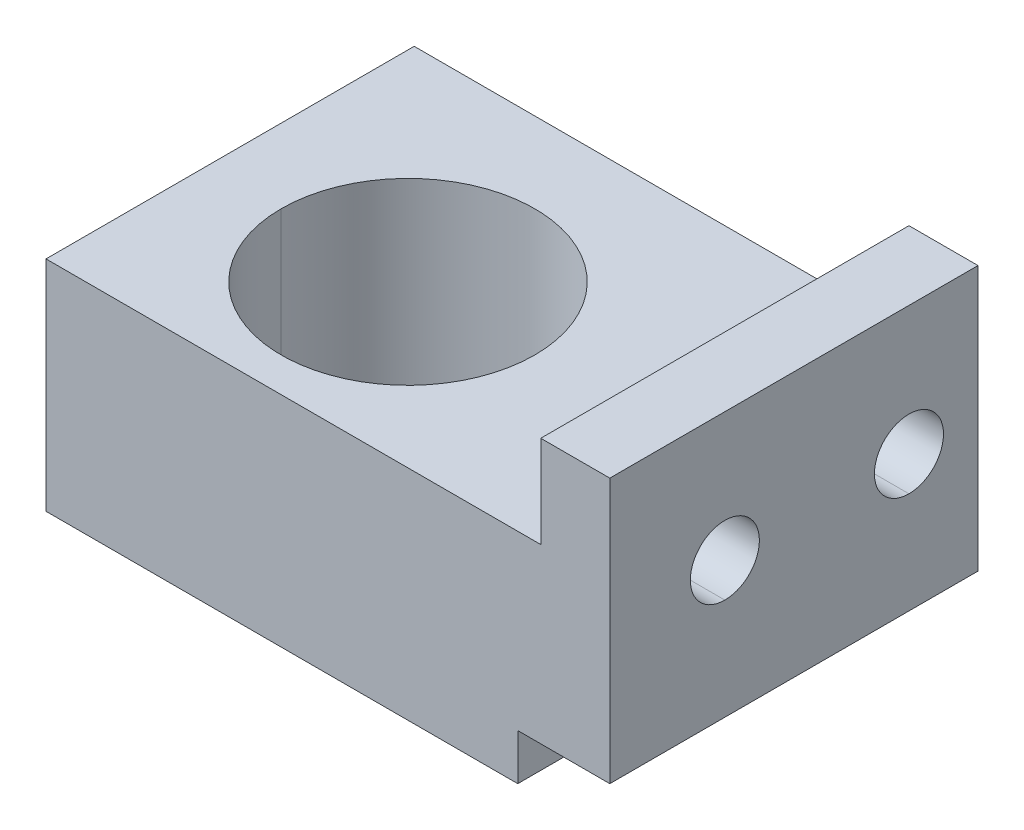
ISO-10303-21;
HEADER;
FILE_DESCRIPTION(('STEP AP214'),'2;1');
FILE_NAME('part.step','',(''),(''),'','','');
FILE_SCHEMA(('AUTOMOTIVE_DESIGN { 1 0 10303 214 1 1 1 1 }'));
ENDSEC;
DATA;
#1=APPLICATION_CONTEXT('core data for automotive mechanical design processes');
#2=APPLICATION_PROTOCOL_DEFINITION('international standard','automotive_design',2000,#1);
#3=PRODUCT_CONTEXT('',#1,'mechanical');
#4=PRODUCT('Part','Part','',(#3));
#5=PRODUCT_RELATED_PRODUCT_CATEGORY('part','',(#4));
#6=PRODUCT_DEFINITION_FORMATION('','',#4);
#7=PRODUCT_DEFINITION_CONTEXT('part definition',#1,'design');
#8=PRODUCT_DEFINITION('design','',#6,#7);
#9=PRODUCT_DEFINITION_SHAPE('','',#8);
#10=(LENGTH_UNIT() NAMED_UNIT(*) SI_UNIT(.MILLI.,.METRE.));
#11=(NAMED_UNIT(*) PLANE_ANGLE_UNIT() SI_UNIT($,.RADIAN.));
#12=(NAMED_UNIT(*) SI_UNIT($,.STERADIAN.) SOLID_ANGLE_UNIT());
#13=UNCERTAINTY_MEASURE_WITH_UNIT(LENGTH_MEASURE(1.E-05),#10,'distance_accuracy_value','');
#14=(GEOMETRIC_REPRESENTATION_CONTEXT(3) GLOBAL_UNCERTAINTY_ASSIGNED_CONTEXT((#13)) GLOBAL_UNIT_ASSIGNED_CONTEXT((#10,
#11,#12)) REPRESENTATION_CONTEXT('',''));
#15=CARTESIAN_POINT('',(0.,0.,0.));
#16=DIRECTION('',(0.,0.,1.));
#17=DIRECTION('',(1.,0.,0.));
#18=AXIS2_PLACEMENT_3D('',#15,#16,#17);
#19=CARTESIAN_POINT('',(29.36875,3.68299999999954,-15.875));
#20=DIRECTION('',(1.,0.,0.));
#21=DIRECTION('',(0.,0.,-1.));
#22=AXIS2_PLACEMENT_3D('',#19,#20,#21);
#23=PLANE('',#22);
#24=CARTESIAN_POINT('',(29.36875,3.68299999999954,-15.875));
#25=DIRECTION('',(-1.,0.,0.));
#26=DIRECTION('',(0.,0.,1.));
#27=AXIS2_PLACEMENT_3D('',#24,#25,#26);
#28=CIRCLE('',#27,4.7625);
#29=CARTESIAN_POINT('',(29.36875,8.44549999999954,-15.875));
#30=VERTEX_POINT('',#29);
#31=CARTESIAN_POINT('',(29.36875,-1.07950000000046,-15.875));
#32=VERTEX_POINT('',#31);
#33=EDGE_CURVE('E19',#30,#32,#28,.T.);
#34=ORIENTED_EDGE('',*,*,#33,.F.);
#35=CARTESIAN_POINT('',(29.36875,3.68299999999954,-15.875));
#36=DIRECTION('',(-1.,0.,0.));
#37=DIRECTION('',(0.,0.,1.));
#38=AXIS2_PLACEMENT_3D('',#35,#36,#37);
#39=CIRCLE('',#38,4.7625);
#40=EDGE_CURVE('E114',#32,#30,#39,.T.);
#41=ORIENTED_EDGE('',*,*,#40,.F.);
#42=EDGE_LOOP('',(#34,#41));
#43=FACE_BOUND('',#42,.T.);
#44=ADVANCED_FACE('F16',(#43),#23,.T.);
#45=CARTESIAN_POINT('',(29.36875,3.68299999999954,9.525));
#46=DIRECTION('',(1.,0.,0.));
#47=DIRECTION('',(0.,0.,-1.));
#48=AXIS2_PLACEMENT_3D('',#45,#46,#47);
#49=PLANE('',#48);
#50=CARTESIAN_POINT('',(29.36875,3.68299999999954,9.525));
#51=DIRECTION('',(-1.,0.,0.));
#52=DIRECTION('',(0.,0.,1.));
#53=AXIS2_PLACEMENT_3D('',#50,#51,#52);
#54=CIRCLE('',#53,4.7625);
#55=CARTESIAN_POINT('',(29.36875,8.44549999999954,9.525));
#56=VERTEX_POINT('',#55);
#57=CARTESIAN_POINT('',(29.36875,-1.07950000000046,9.525));
#58=VERTEX_POINT('',#57);
#59=EDGE_CURVE('E130',#56,#58,#54,.T.);
#60=ORIENTED_EDGE('',*,*,#59,.F.);
#61=CARTESIAN_POINT('',(29.36875,3.68299999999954,9.525));
#62=DIRECTION('',(-1.,0.,0.));
#63=DIRECTION('',(0.,0.,1.));
#64=AXIS2_PLACEMENT_3D('',#61,#62,#63);
#65=CIRCLE('',#64,4.7625);
#66=EDGE_CURVE('E135',#58,#56,#65,.T.);
#67=ORIENTED_EDGE('',*,*,#66,.F.);
#68=EDGE_LOOP('',(#60,#67));
#69=FACE_BOUND('',#68,.T.);
#70=ADVANCED_FACE('F298',(#69),#49,.T.);
#71=CARTESIAN_POINT('',(38.89375,3.68299999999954,-15.875));
#72=DIRECTION('',(-1.,0.,0.));
#73=DIRECTION('',(0.,0.,1.));
#74=AXIS2_PLACEMENT_3D('',#71,#72,#73);
#75=CYLINDRICAL_SURFACE('',#74,4.7625);
#76=DIRECTION('',(-1.,0.,0.));
#77=VECTOR('',#76,1.);
#78=CARTESIAN_POINT('',(38.89375,8.44549999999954,-15.875));
#79=LINE('',#78,#77);
#80=CARTESIAN_POINT('',(38.89375,8.44549999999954,-15.875));
#81=VERTEX_POINT('',#80);
#82=EDGE_CURVE('E124',#30,#81,#79,.F.);
#83=ORIENTED_EDGE('',*,*,#82,.F.);
#84=ORIENTED_EDGE('',*,*,#33,.T.);
#85=DIRECTION('',(-1.,0.,0.));
#86=VECTOR('',#85,1.);
#87=CARTESIAN_POINT('',(38.89375,-1.07950000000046,-15.875));
#88=LINE('',#87,#86);
#89=CARTESIAN_POINT('',(38.89375,-1.07950000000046,-15.875));
#90=VERTEX_POINT('',#89);
#91=EDGE_CURVE('E122',#90,#32,#88,.T.);
#92=ORIENTED_EDGE('',*,*,#91,.F.);
#93=CARTESIAN_POINT('',(38.89375,3.68299999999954,-15.875));
#94=DIRECTION('',(-1.,0.,0.));
#95=DIRECTION('',(0.,0.,1.));
#96=AXIS2_PLACEMENT_3D('',#93,#94,#95);
#97=CIRCLE('',#96,4.7625);
#98=EDGE_CURVE('E138',#90,#81,#97,.F.);
#99=ORIENTED_EDGE('',*,*,#98,.T.);
#100=EDGE_LOOP('',(#83,#84,#92,#99));
#101=FACE_BOUND('',#100,.T.);
#102=ADVANCED_FACE('F120',(#101),#75,.F.);
#103=CARTESIAN_POINT('',(38.89375,3.68299999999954,-15.875));
#104=DIRECTION('',(-1.,0.,0.));
#105=DIRECTION('',(0.,0.,1.));
#106=AXIS2_PLACEMENT_3D('',#103,#104,#105);
#107=CYLINDRICAL_SURFACE('',#106,4.7625);
#108=ORIENTED_EDGE('',*,*,#82,.T.);
#109=CARTESIAN_POINT('',(38.89375,3.68299999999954,-15.875));
#110=DIRECTION('',(-1.,0.,0.));
#111=DIRECTION('',(0.,0.,1.));
#112=AXIS2_PLACEMENT_3D('',#109,#110,#111);
#113=CIRCLE('',#112,4.7625);
#114=EDGE_CURVE('E128',#81,#90,#113,.F.);
#115=ORIENTED_EDGE('',*,*,#114,.T.);
#116=ORIENTED_EDGE('',*,*,#91,.T.);
#117=ORIENTED_EDGE('',*,*,#40,.T.);
#118=EDGE_LOOP('',(#108,#115,#116,#117));
#119=FACE_BOUND('',#118,.T.);
#120=ADVANCED_FACE('F126',(#119),#107,.F.);
#121=CARTESIAN_POINT('',(38.89375,3.68299999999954,9.525));
#122=DIRECTION('',(-1.,0.,0.));
#123=DIRECTION('',(0.,0.,1.));
#124=AXIS2_PLACEMENT_3D('',#121,#122,#123);
#125=CYLINDRICAL_SURFACE('',#124,4.7625);
#126=DIRECTION('',(-1.,0.,0.));
#127=VECTOR('',#126,1.);
#128=CARTESIAN_POINT('',(38.89375,8.44549999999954,9.525));
#129=LINE('',#128,#127);
#130=CARTESIAN_POINT('',(38.89375,8.44549999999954,9.525));
#131=VERTEX_POINT('',#130);
#132=EDGE_CURVE('E137',#56,#131,#129,.F.);
#133=ORIENTED_EDGE('',*,*,#132,.F.);
#134=ORIENTED_EDGE('',*,*,#59,.T.);
#135=DIRECTION('',(-1.,0.,0.));
#136=VECTOR('',#135,1.);
#137=CARTESIAN_POINT('',(38.89375,-1.07950000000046,9.525));
#138=LINE('',#137,#136);
#139=CARTESIAN_POINT('',(38.89375,-1.07950000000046,9.525));
#140=VERTEX_POINT('',#139);
#141=EDGE_CURVE('E134',#140,#58,#138,.T.);
#142=ORIENTED_EDGE('',*,*,#141,.F.);
#143=CARTESIAN_POINT('',(38.89375,3.68299999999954,9.525));
#144=DIRECTION('',(-1.,0.,0.));
#145=DIRECTION('',(0.,0.,1.));
#146=AXIS2_PLACEMENT_3D('',#143,#144,#145);
#147=CIRCLE('',#146,4.7625);
#148=EDGE_CURVE('E141',#140,#131,#147,.F.);
#149=ORIENTED_EDGE('',*,*,#148,.T.);
#150=EDGE_LOOP('',(#133,#134,#142,#149));
#151=FACE_BOUND('',#150,.T.);
#152=ADVANCED_FACE('F290',(#151),#125,.F.);
#153=CARTESIAN_POINT('',(38.89375,3.68299999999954,9.525));
#154=DIRECTION('',(-1.,0.,0.));
#155=DIRECTION('',(0.,0.,1.));
#156=AXIS2_PLACEMENT_3D('',#153,#154,#155);
#157=CYLINDRICAL_SURFACE('',#156,4.7625);
#158=ORIENTED_EDGE('',*,*,#132,.T.);
#159=CARTESIAN_POINT('',(38.89375,3.68299999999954,9.525));
#160=DIRECTION('',(-1.,0.,0.));
#161=DIRECTION('',(0.,0.,1.));
#162=AXIS2_PLACEMENT_3D('',#159,#160,#161);
#163=CIRCLE('',#162,4.7625);
#164=EDGE_CURVE('E144',#131,#140,#163,.F.);
#165=ORIENTED_EDGE('',*,*,#164,.T.);
#166=ORIENTED_EDGE('',*,*,#141,.T.);
#167=ORIENTED_EDGE('',*,*,#66,.T.);
#168=EDGE_LOOP('',(#158,#165,#166,#167));
#169=FACE_BOUND('',#168,.T.);
#170=ADVANCED_FACE('F286',(#169),#157,.F.);
#171=CARTESIAN_POINT('',(38.89375,-21.1772500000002,0.));
#172=DIRECTION('',(-1.,0.,0.));
#173=DIRECTION('',(0.,0.,1.));
#174=AXIS2_PLACEMENT_3D('',#171,#172,#173);
#175=PLANE('',#174);
#176=DIRECTION('',(0.,1.,0.));
#177=VECTOR('',#176,1.);
#178=CARTESIAN_POINT('',(38.89375,-21.1772500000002,-25.4));
#179=LINE('',#178,#177);
#180=CARTESIAN_POINT('',(38.89375,-15.08125,-25.4));
#181=VERTEX_POINT('',#180);
#182=CARTESIAN_POINT('',(38.89375,21.43125,-25.4));
#183=VERTEX_POINT('',#182);
#184=EDGE_CURVE('E198',#181,#183,#179,.T.);
#185=ORIENTED_EDGE('',*,*,#184,.T.);
#186=DIRECTION('',(0.,0.,-1.));
#187=VECTOR('',#186,1.);
#188=CARTESIAN_POINT('',(38.89375,21.43125,0.));
#189=LINE('',#188,#187);
#190=CARTESIAN_POINT('',(38.89375,21.43125,25.4));
#191=VERTEX_POINT('',#190);
#192=EDGE_CURVE('E152',#183,#191,#189,.F.);
#193=ORIENTED_EDGE('',*,*,#192,.T.);
#194=DIRECTION('',(0.,1.,0.));
#195=VECTOR('',#194,1.);
#196=CARTESIAN_POINT('',(38.89375,-21.1772500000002,25.4));
#197=LINE('',#196,#195);
#198=CARTESIAN_POINT('',(38.89375,-15.08125,25.4));
#199=VERTEX_POINT('',#198);
#200=EDGE_CURVE('E187',#191,#199,#197,.F.);
#201=ORIENTED_EDGE('',*,*,#200,.T.);
#202=DIRECTION('',(0.,0.,-1.));
#203=VECTOR('',#202,1.);
#204=CARTESIAN_POINT('',(38.89375,-15.08125,0.));
#205=LINE('',#204,#203);
#206=EDGE_CURVE('E168',#181,#199,#205,.F.);
#207=ORIENTED_EDGE('',*,*,#206,.F.);
#208=EDGE_LOOP('',(#185,#193,#201,#207));
#209=FACE_BOUND('',#208,.T.);
#210=ORIENTED_EDGE('',*,*,#148,.F.);
#211=ORIENTED_EDGE('',*,*,#164,.F.);
#212=EDGE_LOOP('',(#210,#211));
#213=FACE_BOUND('',#212,.T.);
#214=ORIENTED_EDGE('',*,*,#98,.F.);
#215=ORIENTED_EDGE('',*,*,#114,.F.);
#216=EDGE_LOOP('',(#214,#215));
#217=FACE_BOUND('',#216,.T.);
#218=ADVANCED_FACE('F282',(#209,#213,#217),#175,.F.);
#219=CARTESIAN_POINT('',(0.,-21.43125,0.));
#220=DIRECTION('',(0.,-1.,0.));
#221=DIRECTION('',(0.,0.,-1.));
#222=AXIS2_PLACEMENT_3D('',#219,#220,#221);
#223=PLANE('',#222);
#224=DIRECTION('',(0.,0.,-1.));
#225=VECTOR('',#224,1.);
#226=CARTESIAN_POINT('',(-38.89375,-21.43125,0.));
#227=LINE('',#226,#225);
#228=CARTESIAN_POINT('',(-38.89375,-21.43125,25.4));
#229=VERTEX_POINT('',#228);
#230=CARTESIAN_POINT('',(-38.89375,-21.43125,-25.4));
#231=VERTEX_POINT('',#230);
#232=EDGE_CURVE('E193',#229,#231,#227,.T.);
#233=ORIENTED_EDGE('',*,*,#232,.T.);
#234=DIRECTION('',(1.,0.,0.));
#235=VECTOR('',#234,1.);
#236=CARTESIAN_POINT('',(0.,-21.43125,-25.4));
#237=LINE('',#236,#235);
#238=CARTESIAN_POINT('',(26.19375,-21.43125,-25.4));
#239=VERTEX_POINT('',#238);
#240=EDGE_CURVE('E206',#231,#239,#237,.T.);
#241=ORIENTED_EDGE('',*,*,#240,.T.);
#242=DIRECTION('',(0.,0.,-1.));
#243=VECTOR('',#242,1.);
#244=CARTESIAN_POINT('',(26.19375,-21.43125,0.));
#245=LINE('',#244,#243);
#246=CARTESIAN_POINT('',(26.19375,-21.43125,25.4));
#247=VERTEX_POINT('',#246);
#248=EDGE_CURVE('E147',#247,#239,#245,.T.);
#249=ORIENTED_EDGE('',*,*,#248,.F.);
#250=DIRECTION('',(-1.,0.,0.));
#251=VECTOR('',#250,1.);
#252=CARTESIAN_POINT('',(0.,-21.43125,25.4));
#253=LINE('',#252,#251);
#254=EDGE_CURVE('E181',#247,#229,#253,.T.);
#255=ORIENTED_EDGE('',*,*,#254,.T.);
#256=EDGE_LOOP('',(#233,#241,#249,#255));
#257=FACE_BOUND('',#256,.T.);
#258=CARTESIAN_POINT('',(-11.1767298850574,-21.43125,3.175));
#259=DIRECTION('',(0.,-1.,0.));
#260=DIRECTION('',(0.,0.,-1.));
#261=AXIS2_PLACEMENT_3D('',#258,#259,#260);
#262=CIRCLE('',#261,17.4879);
#263=CARTESIAN_POINT('',(6.31117011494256,-21.43125,3.175));
#264=VERTEX_POINT('',#263);
#265=CARTESIAN_POINT('',(-28.6646298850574,-21.43125,3.175));
#266=VERTEX_POINT('',#265);
#267=EDGE_CURVE('E151',#264,#266,#262,.F.);
#268=ORIENTED_EDGE('',*,*,#267,.T.);
#269=CARTESIAN_POINT('',(-11.1767298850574,-21.43125,3.175));
#270=DIRECTION('',(0.,-1.,0.));
#271=DIRECTION('',(0.,0.,-1.));
#272=AXIS2_PLACEMENT_3D('',#269,#270,#271);
#273=CIRCLE('',#272,17.4879);
#274=EDGE_CURVE('E148',#266,#264,#273,.F.);
#275=ORIENTED_EDGE('',*,*,#274,.T.);
#276=EDGE_LOOP('',(#268,#275));
#277=FACE_BOUND('',#276,.T.);
#278=ADVANCED_FACE('F278',(#257,#277),#223,.T.);
#279=CARTESIAN_POINT('',(26.19375,-18.25625,0.));
#280=DIRECTION('',(1.,0.,0.));
#281=DIRECTION('',(0.,0.,-1.));
#282=AXIS2_PLACEMENT_3D('',#279,#280,#281);
#283=PLANE('',#282);
#284=ORIENTED_EDGE('',*,*,#248,.T.);
#285=DIRECTION('',(0.,1.,0.));
#286=VECTOR('',#285,1.);
#287=CARTESIAN_POINT('',(26.19375,-21.1772500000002,-25.4));
#288=LINE('',#287,#286);
#289=CARTESIAN_POINT('',(26.19375,-15.08125,-25.4));
#290=VERTEX_POINT('',#289);
#291=EDGE_CURVE('E209',#239,#290,#288,.T.);
#292=ORIENTED_EDGE('',*,*,#291,.T.);
#293=DIRECTION('',(0.,0.,-1.));
#294=VECTOR('',#293,1.);
#295=CARTESIAN_POINT('',(26.19375,-15.08125,0.));
#296=LINE('',#295,#294);
#297=CARTESIAN_POINT('',(26.19375,-15.08125,25.4));
#298=VERTEX_POINT('',#297);
#299=EDGE_CURVE('E170',#298,#290,#296,.T.);
#300=ORIENTED_EDGE('',*,*,#299,.F.);
#301=DIRECTION('',(0.,1.,0.));
#302=VECTOR('',#301,1.);
#303=CARTESIAN_POINT('',(26.19375,-21.1772500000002,25.4));
#304=LINE('',#303,#302);
#305=EDGE_CURVE('E176',#298,#247,#304,.F.);
#306=ORIENTED_EDGE('',*,*,#305,.T.);
#307=EDGE_LOOP('',(#284,#292,#300,#306));
#308=FACE_BOUND('',#307,.T.);
#309=ADVANCED_FACE('F274',(#308),#283,.T.);
#310=CARTESIAN_POINT('',(32.54375,-15.08125,0.));
#311=DIRECTION('',(0.,-1.,0.));
#312=DIRECTION('',(0.,0.,-1.));
#313=AXIS2_PLACEMENT_3D('',#310,#311,#312);
#314=PLANE('',#313);
#315=ORIENTED_EDGE('',*,*,#299,.T.);
#316=DIRECTION('',(1.,0.,0.));
#317=VECTOR('',#316,1.);
#318=CARTESIAN_POINT('',(0.,-15.08125,-25.4));
#319=LINE('',#318,#317);
#320=EDGE_CURVE('E212',#290,#181,#319,.T.);
#321=ORIENTED_EDGE('',*,*,#320,.T.);
#322=ORIENTED_EDGE('',*,*,#206,.T.);
#323=DIRECTION('',(-1.,0.,0.));
#324=VECTOR('',#323,1.);
#325=CARTESIAN_POINT('',(0.,-15.08125,25.4));
#326=LINE('',#325,#324);
#327=EDGE_CURVE('E190',#199,#298,#326,.T.);
#328=ORIENTED_EDGE('',*,*,#327,.T.);
#329=EDGE_LOOP('',(#315,#321,#322,#328));
#330=FACE_BOUND('',#329,.T.);
#331=ADVANCED_FACE('F270',(#330),#314,.T.);
#332=CARTESIAN_POINT('',(34.925,21.43125,0.));
#333=DIRECTION('',(0.,-1.,0.));
#334=DIRECTION('',(0.,0.,-1.));
#335=AXIS2_PLACEMENT_3D('',#332,#333,#334);
#336=PLANE('',#335);
#337=DIRECTION('',(1.,0.,0.));
#338=VECTOR('',#337,1.);
#339=CARTESIAN_POINT('',(0.,21.43125,-25.4));
#340=LINE('',#339,#338);
#341=CARTESIAN_POINT('',(29.36875,21.43125,-25.4));
#342=VERTEX_POINT('',#341);
#343=EDGE_CURVE('E201',#183,#342,#340,.F.);
#344=ORIENTED_EDGE('',*,*,#343,.T.);
#345=DIRECTION('',(0.,0.,-1.));
#346=VECTOR('',#345,1.);
#347=CARTESIAN_POINT('',(29.36875,21.43125,0.));
#348=LINE('',#347,#346);
#349=CARTESIAN_POINT('',(29.36875,21.43125,25.4));
#350=VERTEX_POINT('',#349);
#351=EDGE_CURVE('E160',#342,#350,#348,.F.);
#352=ORIENTED_EDGE('',*,*,#351,.T.);
#353=DIRECTION('',(-1.,0.,0.));
#354=VECTOR('',#353,1.);
#355=CARTESIAN_POINT('',(0.,21.43125,25.4));
#356=LINE('',#355,#354);
#357=EDGE_CURVE('E184',#350,#191,#356,.F.);
#358=ORIENTED_EDGE('',*,*,#357,.T.);
#359=ORIENTED_EDGE('',*,*,#192,.F.);
#360=EDGE_LOOP('',(#344,#352,#358,#359));
#361=FACE_BOUND('',#360,.T.);
#362=ADVANCED_FACE('F266',(#361),#336,.F.);
#363=CARTESIAN_POINT('',(-11.1767298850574,3.96875,3.175));
#364=DIRECTION('',(0.,-1.,0.));
#365=DIRECTION('',(0.,0.,-1.));
#366=AXIS2_PLACEMENT_3D('',#363,#364,#365);
#367=CYLINDRICAL_SURFACE('',#366,17.4879);
#368=ORIENTED_EDGE('',*,*,#274,.F.);
#369=DIRECTION('',(0.,-1.,0.));
#370=VECTOR('',#369,1.);
#371=CARTESIAN_POINT('',(-28.6646298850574,3.96875,3.175));
#372=LINE('',#371,#370);
#373=CARTESIAN_POINT('',(-28.6646298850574,8.73124999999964,3.175));
#374=VERTEX_POINT('',#373);
#375=EDGE_CURVE('E155',#266,#374,#372,.F.);
#376=ORIENTED_EDGE('',*,*,#375,.T.);
#377=CARTESIAN_POINT('',(-11.1767298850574,8.73124999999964,3.175));
#378=DIRECTION('',(0.,-1.,0.));
#379=DIRECTION('',(0.,0.,-1.));
#380=AXIS2_PLACEMENT_3D('',#377,#378,#379);
#381=CIRCLE('',#380,17.4879);
#382=CARTESIAN_POINT('',(6.31117011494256,8.73124999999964,3.175));
#383=VERTEX_POINT('',#382);
#384=EDGE_CURVE('E156',#374,#383,#381,.F.);
#385=ORIENTED_EDGE('',*,*,#384,.T.);
#386=DIRECTION('',(0.,-1.,0.));
#387=VECTOR('',#386,1.);
#388=CARTESIAN_POINT('',(6.31117011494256,3.96875,3.175));
#389=LINE('',#388,#387);
#390=EDGE_CURVE('E173',#383,#264,#389,.T.);
#391=ORIENTED_EDGE('',*,*,#390,.T.);
#392=EDGE_LOOP('',(#368,#376,#385,#391));
#393=FACE_BOUND('',#392,.T.);
#394=ADVANCED_FACE('F262',(#393),#367,.F.);
#395=CARTESIAN_POINT('',(-11.1767298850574,3.96875,3.175));
#396=DIRECTION('',(0.,-1.,0.));
#397=DIRECTION('',(0.,0.,-1.));
#398=AXIS2_PLACEMENT_3D('',#395,#396,#397);
#399=CYLINDRICAL_SURFACE('',#398,17.4879);
#400=CARTESIAN_POINT('',(-11.1767298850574,8.73124999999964,3.175));
#401=DIRECTION('',(0.,-1.,0.));
#402=DIRECTION('',(0.,0.,-1.));
#403=AXIS2_PLACEMENT_3D('',#400,#401,#402);
#404=CIRCLE('',#403,17.4879);
#405=EDGE_CURVE('E159',#383,#374,#404,.F.);
#406=ORIENTED_EDGE('',*,*,#405,.T.);
#407=ORIENTED_EDGE('',*,*,#375,.F.);
#408=ORIENTED_EDGE('',*,*,#267,.F.);
#409=ORIENTED_EDGE('',*,*,#390,.F.);
#410=EDGE_LOOP('',(#406,#407,#408,#409));
#411=FACE_BOUND('',#410,.T.);
#412=ADVANCED_FACE('F259',(#411),#399,.F.);
#413=CARTESIAN_POINT('',(0.,-21.1772500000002,25.4));
#414=DIRECTION('',(0.,0.,-1.));
#415=DIRECTION('',(-1.,0.,0.));
#416=AXIS2_PLACEMENT_3D('',#413,#414,#415);
#417=PLANE('',#416);
#418=ORIENTED_EDGE('',*,*,#200,.F.);
#419=ORIENTED_EDGE('',*,*,#357,.F.);
#420=DIRECTION('',(0.,1.,0.));
#421=VECTOR('',#420,1.);
#422=CARTESIAN_POINT('',(29.36875,15.08125,25.4));
#423=LINE('',#422,#421);
#424=CARTESIAN_POINT('',(29.36875,8.73124999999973,25.4));
#425=VERTEX_POINT('',#424);
#426=EDGE_CURVE('E215',#350,#425,#423,.F.);
#427=ORIENTED_EDGE('',*,*,#426,.T.);
#428=DIRECTION('',(1.,0.,0.));
#429=VECTOR('',#428,1.);
#430=CARTESIAN_POINT('',(-30.2267298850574,8.73124999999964,25.4));
#431=LINE('',#430,#429);
#432=CARTESIAN_POINT('',(-38.89375,8.73124999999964,25.4));
#433=VERTEX_POINT('',#432);
#434=EDGE_CURVE('E162',#425,#433,#431,.F.);
#435=ORIENTED_EDGE('',*,*,#434,.T.);
#436=DIRECTION('',(0.,1.,0.));
#437=VECTOR('',#436,1.);
#438=CARTESIAN_POINT('',(-38.89375,-21.1772500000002,25.4));
#439=LINE('',#438,#437);
#440=EDGE_CURVE('E195',#433,#229,#439,.F.);
#441=ORIENTED_EDGE('',*,*,#440,.T.);
#442=ORIENTED_EDGE('',*,*,#254,.F.);
#443=ORIENTED_EDGE('',*,*,#305,.F.);
#444=ORIENTED_EDGE('',*,*,#327,.F.);
#445=EDGE_LOOP('',(#418,#419,#427,#435,#441,#442,#443,#444));
#446=FACE_BOUND('',#445,.T.);
#447=ADVANCED_FACE('F242',(#446),#417,.F.);
#448=CARTESIAN_POINT('',(-38.89375,-21.1772500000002,0.));
#449=DIRECTION('',(1.,0.,0.));
#450=DIRECTION('',(0.,0.,-1.));
#451=AXIS2_PLACEMENT_3D('',#448,#449,#450);
#452=PLANE('',#451);
#453=DIRECTION('',(0.,0.,-1.));
#454=VECTOR('',#453,1.);
#455=CARTESIAN_POINT('',(-38.89375,8.73124999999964,-19.84375));
#456=LINE('',#455,#454);
#457=CARTESIAN_POINT('',(-38.89375,8.73124999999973,-25.4));
#458=VERTEX_POINT('',#457);
#459=EDGE_CURVE('E223',#433,#458,#456,.T.);
#460=ORIENTED_EDGE('',*,*,#459,.T.);
#461=DIRECTION('',(0.,1.,0.));
#462=VECTOR('',#461,1.);
#463=CARTESIAN_POINT('',(-38.89375,-21.1772500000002,-25.4));
#464=LINE('',#463,#462);
#465=EDGE_CURVE('E203',#458,#231,#464,.F.);
#466=ORIENTED_EDGE('',*,*,#465,.T.);
#467=ORIENTED_EDGE('',*,*,#232,.F.);
#468=ORIENTED_EDGE('',*,*,#440,.F.);
#469=EDGE_LOOP('',(#460,#466,#467,#468));
#470=FACE_BOUND('',#469,.T.);
#471=ADVANCED_FACE('F238',(#470),#452,.F.);
#472=CARTESIAN_POINT('',(0.,-21.1772500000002,-25.4));
#473=DIRECTION('',(0.,0.,1.));
#474=DIRECTION('',(1.,0.,0.));
#475=AXIS2_PLACEMENT_3D('',#472,#473,#474);
#476=PLANE('',#475);
#477=ORIENTED_EDGE('',*,*,#291,.F.);
#478=ORIENTED_EDGE('',*,*,#240,.F.);
#479=ORIENTED_EDGE('',*,*,#465,.F.);
#480=DIRECTION('',(1.,0.,0.));
#481=VECTOR('',#480,1.);
#482=CARTESIAN_POINT('',(-30.2267298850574,8.73124999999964,-25.4));
#483=LINE('',#482,#481);
#484=CARTESIAN_POINT('',(29.36875,8.73124999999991,-25.4));
#485=VERTEX_POINT('',#484);
#486=EDGE_CURVE('E25',#458,#485,#483,.T.);
#487=ORIENTED_EDGE('',*,*,#486,.T.);
#488=DIRECTION('',(0.,1.,0.));
#489=VECTOR('',#488,1.);
#490=CARTESIAN_POINT('',(29.36875,15.08125,-25.4));
#491=LINE('',#490,#489);
#492=EDGE_CURVE('E33',#485,#342,#491,.T.);
#493=ORIENTED_EDGE('',*,*,#492,.T.);
#494=ORIENTED_EDGE('',*,*,#343,.F.);
#495=ORIENTED_EDGE('',*,*,#184,.F.);
#496=ORIENTED_EDGE('',*,*,#320,.F.);
#497=EDGE_LOOP('',(#477,#478,#479,#487,#493,#494,#495,#496));
#498=FACE_BOUND('',#497,.T.);
#499=ADVANCED_FACE('F230',(#498),#476,.F.);
#500=CARTESIAN_POINT('',(29.36875,15.08125,0.));
#501=DIRECTION('',(1.,0.,0.));
#502=DIRECTION('',(0.,0.,-1.));
#503=AXIS2_PLACEMENT_3D('',#500,#501,#502);
#504=PLANE('',#503);
#505=ORIENTED_EDGE('',*,*,#492,.F.);
#506=DIRECTION('',(0.,0.,-1.));
#507=VECTOR('',#506,1.);
#508=CARTESIAN_POINT('',(29.36875,8.73124999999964,-19.84375));
#509=LINE('',#508,#507);
#510=EDGE_CURVE('E11',#485,#425,#509,.F.);
#511=ORIENTED_EDGE('',*,*,#510,.T.);
#512=ORIENTED_EDGE('',*,*,#426,.F.);
#513=ORIENTED_EDGE('',*,*,#351,.F.);
#514=EDGE_LOOP('',(#505,#511,#512,#513));
#515=FACE_BOUND('',#514,.T.);
#516=ADVANCED_FACE('F244',(#515),#504,.F.);
#517=CARTESIAN_POINT('',(-30.2267298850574,8.73124999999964,-19.84375));
#518=DIRECTION('',(0.,-1.,0.));
#519=DIRECTION('',(0.,0.,-1.));
#520=AXIS2_PLACEMENT_3D('',#517,#518,#519);
#521=PLANE('',#520);
#522=ORIENTED_EDGE('',*,*,#486,.F.);
#523=ORIENTED_EDGE('',*,*,#459,.F.);
#524=ORIENTED_EDGE('',*,*,#434,.F.);
#525=ORIENTED_EDGE('',*,*,#510,.F.);
#526=EDGE_LOOP('',(#522,#523,#524,#525));
#527=FACE_BOUND('',#526,.T.);
#528=ORIENTED_EDGE('',*,*,#384,.F.);
#529=ORIENTED_EDGE('',*,*,#405,.F.);
#530=EDGE_LOOP('',(#528,#529));
#531=FACE_BOUND('',#530,.T.);
#532=ADVANCED_FACE('F235',(#527,#531),#521,.F.);
#533=CLOSED_SHELL('',(#44,#70,#102,#120,#152,#170,#218,#278,#309,#331,#362,#394,#412,#447,#471,
#499,#516,#532));
#534=MANIFOLD_SOLID_BREP('B1',#533);
#535=ADVANCED_BREP_SHAPE_REPRESENTATION('',(#18,#534),#14);
#536=SHAPE_DEFINITION_REPRESENTATION(#9,#535);
ENDSEC;
END-ISO-10303-21;
